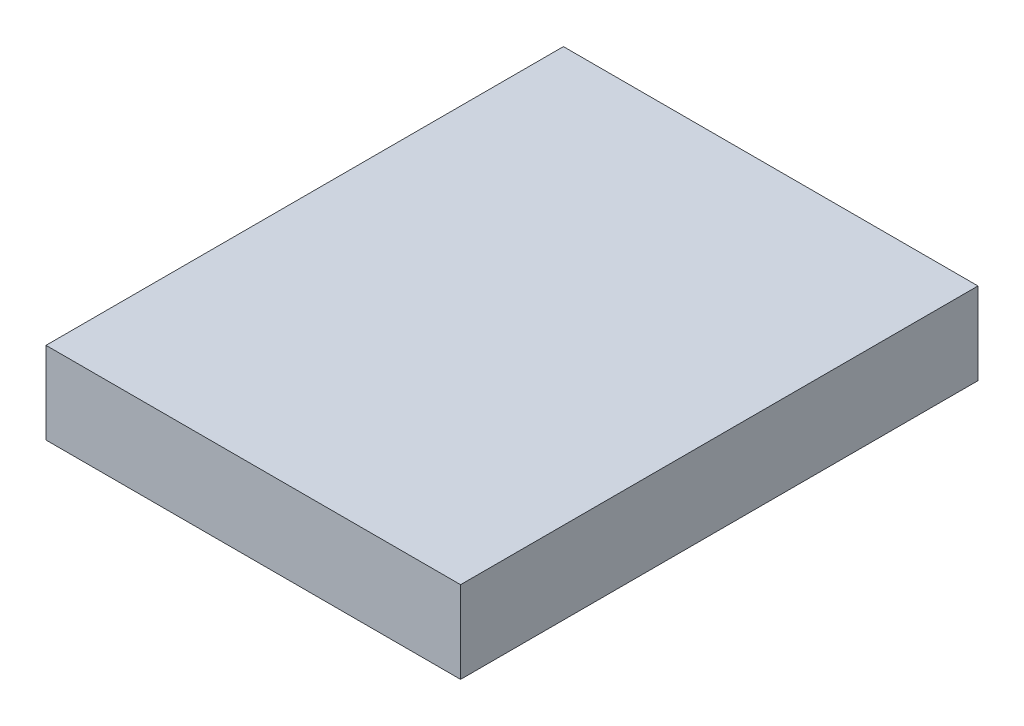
ISO-10303-21;
HEADER;
FILE_DESCRIPTION(('STEP AP214'),'2;1');
FILE_NAME('part.step','',(''),(''),'','','');
FILE_SCHEMA(('AUTOMOTIVE_DESIGN { 1 0 10303 214 1 1 1 1 }'));
ENDSEC;
DATA;
#1=APPLICATION_CONTEXT('core data for automotive mechanical design processes');
#2=APPLICATION_PROTOCOL_DEFINITION('international standard','automotive_design',2000,#1);
#3=PRODUCT_CONTEXT('',#1,'mechanical');
#4=PRODUCT('Part','Part','',(#3));
#5=PRODUCT_RELATED_PRODUCT_CATEGORY('part','',(#4));
#6=PRODUCT_DEFINITION_FORMATION('','',#4);
#7=PRODUCT_DEFINITION_CONTEXT('part definition',#1,'design');
#8=PRODUCT_DEFINITION('design','',#6,#7);
#9=PRODUCT_DEFINITION_SHAPE('','',#8);
#10=(LENGTH_UNIT() NAMED_UNIT(*) SI_UNIT(.MILLI.,.METRE.));
#11=(NAMED_UNIT(*) PLANE_ANGLE_UNIT() SI_UNIT($,.RADIAN.));
#12=(NAMED_UNIT(*) SI_UNIT($,.STERADIAN.) SOLID_ANGLE_UNIT());
#13=UNCERTAINTY_MEASURE_WITH_UNIT(LENGTH_MEASURE(1.E-05),#10,'distance_accuracy_value','');
#14=(GEOMETRIC_REPRESENTATION_CONTEXT(3) GLOBAL_UNCERTAINTY_ASSIGNED_CONTEXT((#13)) GLOBAL_UNIT_ASSIGNED_CONTEXT((#10,
#11,#12)) REPRESENTATION_CONTEXT('',''));
#15=CARTESIAN_POINT('',(0.,0.,0.));
#16=DIRECTION('',(0.,0.,1.));
#17=DIRECTION('',(1.,0.,0.));
#18=AXIS2_PLACEMENT_3D('',#15,#16,#17);
#19=CARTESIAN_POINT('',(0.,0.,64.));
#20=DIRECTION('',(1.,0.,0.));
#21=DIRECTION('',(0.,0.,-1.));
#22=AXIS2_PLACEMENT_3D('',#19,#20,#21);
#23=PLANE('',#22);
#24=DIRECTION('',(0.,-1.,0.));
#25=VECTOR('',#24,1.);
#26=CARTESIAN_POINT('',(0.,0.,0.));
#27=LINE('',#26,#25);
#28=CARTESIAN_POINT('',(0.,10.1481028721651,0.));
#29=VERTEX_POINT('',#28);
#30=CARTESIAN_POINT('',(0.,0.,0.));
#31=VERTEX_POINT('',#30);
#32=EDGE_CURVE('E94',#29,#31,#27,.T.);
#33=ORIENTED_EDGE('',*,*,#32,.T.);
#34=DIRECTION('',(0.,0.,-1.));
#35=VECTOR('',#34,1.);
#36=CARTESIAN_POINT('',(0.,0.,64.));
#37=LINE('',#36,#35);
#38=CARTESIAN_POINT('',(0.,0.,64.));
#39=VERTEX_POINT('',#38);
#40=EDGE_CURVE('E11',#39,#31,#37,.T.);
#41=ORIENTED_EDGE('',*,*,#40,.F.);
#42=DIRECTION('',(0.,-1.,0.));
#43=VECTOR('',#42,1.);
#44=CARTESIAN_POINT('',(0.,0.,64.));
#45=LINE('',#44,#43);
#46=CARTESIAN_POINT('',(0.,10.1481028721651,64.));
#47=VERTEX_POINT('',#46);
#48=EDGE_CURVE('E82',#47,#39,#45,.T.);
#49=ORIENTED_EDGE('',*,*,#48,.F.);
#50=DIRECTION('',(0.,0.,-1.));
#51=VECTOR('',#50,1.);
#52=CARTESIAN_POINT('',(0.,10.1481028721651,64.));
#53=LINE('',#52,#51);
#54=EDGE_CURVE('E90',#47,#29,#53,.T.);
#55=ORIENTED_EDGE('',*,*,#54,.T.);
#56=EDGE_LOOP('',(#33,#41,#49,#55));
#57=FACE_BOUND('',#56,.T.);
#58=ADVANCED_FACE('F31',(#57),#23,.F.);
#59=CARTESIAN_POINT('',(0.,0.,64.));
#60=DIRECTION('',(0.,1.,0.));
#61=DIRECTION('',(0.,0.,1.));
#62=AXIS2_PLACEMENT_3D('',#59,#60,#61);
#63=PLANE('',#62);
#64=DIRECTION('',(1.,0.,0.));
#65=VECTOR('',#64,1.);
#66=CARTESIAN_POINT('',(0.,0.,0.));
#67=LINE('',#66,#65);
#68=CARTESIAN_POINT('',(51.2792793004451,0.,0.));
#69=VERTEX_POINT('',#68);
#70=EDGE_CURVE('E86',#31,#69,#67,.T.);
#71=ORIENTED_EDGE('',*,*,#70,.T.);
#72=DIRECTION('',(0.,0.,-1.));
#73=VECTOR('',#72,1.);
#74=CARTESIAN_POINT('',(51.2792793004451,0.,64.));
#75=LINE('',#74,#73);
#76=CARTESIAN_POINT('',(51.2792793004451,0.,64.));
#77=VERTEX_POINT('',#76);
#78=EDGE_CURVE('E39',#77,#69,#75,.T.);
#79=ORIENTED_EDGE('',*,*,#78,.F.);
#80=DIRECTION('',(1.,0.,0.));
#81=VECTOR('',#80,1.);
#82=CARTESIAN_POINT('',(0.,0.,64.));
#83=LINE('',#82,#81);
#84=EDGE_CURVE('E77',#39,#77,#83,.T.);
#85=ORIENTED_EDGE('',*,*,#84,.F.);
#86=ORIENTED_EDGE('',*,*,#40,.T.);
#87=EDGE_LOOP('',(#71,#79,#85,#86));
#88=FACE_BOUND('',#87,.T.);
#89=ADVANCED_FACE('F85',(#88),#63,.F.);
#90=CARTESIAN_POINT('',(51.2792793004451,0.,64.));
#91=DIRECTION('',(-1.,0.,0.));
#92=DIRECTION('',(0.,0.,1.));
#93=AXIS2_PLACEMENT_3D('',#90,#91,#92);
#94=PLANE('',#93);
#95=DIRECTION('',(0.,1.,0.));
#96=VECTOR('',#95,1.);
#97=CARTESIAN_POINT('',(51.2792793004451,0.,0.));
#98=LINE('',#97,#96);
#99=CARTESIAN_POINT('',(51.2792793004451,10.1481028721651,0.));
#100=VERTEX_POINT('',#99);
#101=EDGE_CURVE('E64',#69,#100,#98,.T.);
#102=ORIENTED_EDGE('',*,*,#101,.T.);
#103=DIRECTION('',(0.,0.,-1.));
#104=VECTOR('',#103,1.);
#105=CARTESIAN_POINT('',(51.2792793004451,10.1481028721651,64.));
#106=LINE('',#105,#104);
#107=CARTESIAN_POINT('',(51.2792793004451,10.1481028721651,64.));
#108=VERTEX_POINT('',#107);
#109=EDGE_CURVE('E87',#108,#100,#106,.T.);
#110=ORIENTED_EDGE('',*,*,#109,.F.);
#111=DIRECTION('',(0.,1.,0.));
#112=VECTOR('',#111,1.);
#113=CARTESIAN_POINT('',(51.2792793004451,0.,64.));
#114=LINE('',#113,#112);
#115=EDGE_CURVE('E80',#77,#108,#114,.T.);
#116=ORIENTED_EDGE('',*,*,#115,.F.);
#117=ORIENTED_EDGE('',*,*,#78,.T.);
#118=EDGE_LOOP('',(#102,#110,#116,#117));
#119=FACE_BOUND('',#118,.T.);
#120=ADVANCED_FACE('F88',(#119),#94,.F.);
#121=CARTESIAN_POINT('',(0.,10.1481028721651,64.));
#122=DIRECTION('',(0.,-1.,0.));
#123=DIRECTION('',(0.,0.,-1.));
#124=AXIS2_PLACEMENT_3D('',#121,#122,#123);
#125=PLANE('',#124);
#126=DIRECTION('',(-1.,0.,0.));
#127=VECTOR('',#126,1.);
#128=CARTESIAN_POINT('',(0.,10.1481028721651,0.));
#129=LINE('',#128,#127);
#130=EDGE_CURVE('E70',#100,#29,#129,.T.);
#131=ORIENTED_EDGE('',*,*,#130,.T.);
#132=ORIENTED_EDGE('',*,*,#54,.F.);
#133=DIRECTION('',(-1.,0.,0.));
#134=VECTOR('',#133,1.);
#135=CARTESIAN_POINT('',(0.,10.1481028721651,64.));
#136=LINE('',#135,#134);
#137=EDGE_CURVE('E47',#108,#47,#136,.T.);
#138=ORIENTED_EDGE('',*,*,#137,.F.);
#139=ORIENTED_EDGE('',*,*,#109,.T.);
#140=EDGE_LOOP('',(#131,#132,#138,#139));
#141=FACE_BOUND('',#140,.T.);
#142=ADVANCED_FACE('F101',(#141),#125,.F.);
#143=CARTESIAN_POINT('',(0.,10.1481028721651,64.));
#144=DIRECTION('',(0.,0.,-1.));
#145=DIRECTION('',(-1.,0.,0.));
#146=AXIS2_PLACEMENT_3D('',#143,#144,#145);
#147=PLANE('',#146);
#148=ORIENTED_EDGE('',*,*,#48,.T.);
#149=ORIENTED_EDGE('',*,*,#84,.T.);
#150=ORIENTED_EDGE('',*,*,#115,.T.);
#151=ORIENTED_EDGE('',*,*,#137,.T.);
#152=EDGE_LOOP('',(#148,#149,#150,#151));
#153=FACE_BOUND('',#152,.T.);
#154=ADVANCED_FACE('F78',(#153),#147,.F.);
#155=CARTESIAN_POINT('',(0.,10.1481028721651,0.));
#156=DIRECTION('',(0.,0.,-1.));
#157=DIRECTION('',(-1.,0.,0.));
#158=AXIS2_PLACEMENT_3D('',#155,#156,#157);
#159=PLANE('',#158);
#160=ORIENTED_EDGE('',*,*,#32,.F.);
#161=ORIENTED_EDGE('',*,*,#130,.F.);
#162=ORIENTED_EDGE('',*,*,#101,.F.);
#163=ORIENTED_EDGE('',*,*,#70,.F.);
#164=EDGE_LOOP('',(#160,#161,#162,#163));
#165=FACE_BOUND('',#164,.T.);
#166=ADVANCED_FACE('F104',(#165),#159,.T.);
#167=CLOSED_SHELL('',(#58,#89,#120,#142,#154,#166));
#168=MANIFOLD_SOLID_BREP('B2',#167);
#169=ADVANCED_BREP_SHAPE_REPRESENTATION('',(#18,#168),#14);
#170=SHAPE_DEFINITION_REPRESENTATION(#9,#169);
ENDSEC;
END-ISO-10303-21;
